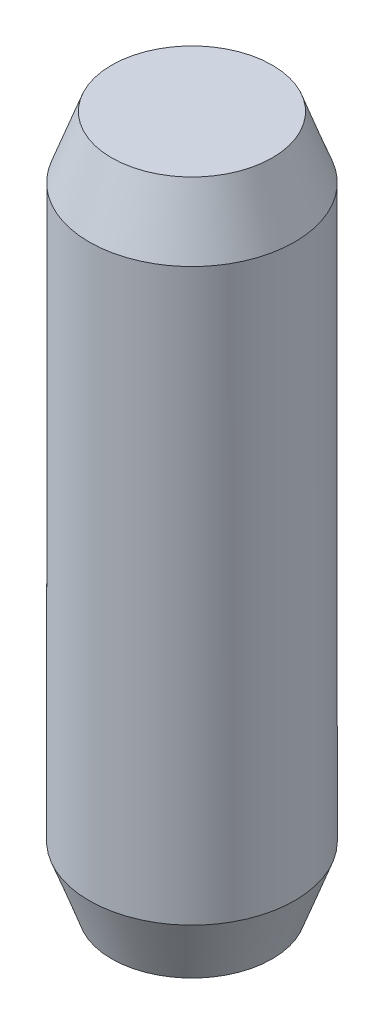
ISO-10303-21;
HEADER;
FILE_DESCRIPTION(('STEP AP214'),'2;1');
FILE_NAME('part.step','',(''),(''),'','','');
FILE_SCHEMA(('AUTOMOTIVE_DESIGN { 1 0 10303 214 1 1 1 1 }'));
ENDSEC;
DATA;
#1=APPLICATION_CONTEXT('core data for automotive mechanical design processes');
#2=APPLICATION_PROTOCOL_DEFINITION('international standard','automotive_design',2000,#1);
#3=PRODUCT_CONTEXT('',#1,'mechanical');
#4=PRODUCT('Part','Part','',(#3));
#5=PRODUCT_RELATED_PRODUCT_CATEGORY('part','',(#4));
#6=PRODUCT_DEFINITION_FORMATION('','',#4);
#7=PRODUCT_DEFINITION_CONTEXT('part definition',#1,'design');
#8=PRODUCT_DEFINITION('design','',#6,#7);
#9=PRODUCT_DEFINITION_SHAPE('','',#8);
#10=(LENGTH_UNIT() NAMED_UNIT(*) SI_UNIT(.MILLI.,.METRE.));
#11=(NAMED_UNIT(*) PLANE_ANGLE_UNIT() SI_UNIT($,.RADIAN.));
#12=(NAMED_UNIT(*) SI_UNIT($,.STERADIAN.) SOLID_ANGLE_UNIT());
#13=UNCERTAINTY_MEASURE_WITH_UNIT(LENGTH_MEASURE(1.E-05),#10,'distance_accuracy_value','');
#14=(GEOMETRIC_REPRESENTATION_CONTEXT(3) GLOBAL_UNCERTAINTY_ASSIGNED_CONTEXT((#13)) GLOBAL_UNIT_ASSIGNED_CONTEXT((#10,
#11,#12)) REPRESENTATION_CONTEXT('',''));
#15=CARTESIAN_POINT('',(0.,0.,0.));
#16=DIRECTION('',(0.,0.,1.));
#17=DIRECTION('',(1.,0.,0.));
#18=AXIS2_PLACEMENT_3D('',#15,#16,#17);
#19=CARTESIAN_POINT('',(0.,13.5,0.));
#20=DIRECTION('',(0.,1.,0.));
#21=DIRECTION('',(0.,0.,1.));
#22=AXIS2_PLACEMENT_3D('',#19,#20,#21);
#23=PLANE('',#22);
#24=CARTESIAN_POINT('',(0.,13.499999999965,0.));
#25=DIRECTION('',(0.,-1.,0.));
#26=DIRECTION('',(0.,0.,-1.));
#27=AXIS2_PLACEMENT_3D('',#24,#25,#26);
#28=CIRCLE('',#27,1.56323571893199);
#29=CARTESIAN_POINT('',(0.,13.499999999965,-1.56323571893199));
#30=VERTEX_POINT('',#29);
#31=EDGE_CURVE('E17',#30,#30,#28,.T.);
#32=ORIENTED_EDGE('',*,*,#31,.F.);
#33=EDGE_LOOP('',(#32));
#34=FACE_BOUND('',#33,.T.);
#35=ADVANCED_FACE('F14',(#34),#23,.T.);
#36=CARTESIAN_POINT('',(0.,0.,0.));
#37=DIRECTION('',(0.,1.,0.));
#38=DIRECTION('',(0.,0.,1.));
#39=AXIS2_PLACEMENT_3D('',#36,#37,#38);
#40=PLANE('',#39);
#41=CARTESIAN_POINT('',(0.,-5.6843418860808E-11,0.));
#42=DIRECTION('',(0.,1.,0.));
#43=DIRECTION('',(0.,0.,1.));
#44=AXIS2_PLACEMENT_3D('',#41,#42,#43);
#45=CIRCLE('',#44,1.56323571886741);
#46=CARTESIAN_POINT('',(0.,-5.6843418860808E-11,1.56323571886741));
#47=VERTEX_POINT('',#46);
#48=EDGE_CURVE('E26',#47,#47,#45,.T.);
#49=ORIENTED_EDGE('',*,*,#48,.F.);
#50=EDGE_LOOP('',(#49));
#51=FACE_BOUND('',#50,.T.);
#52=ADVANCED_FACE('F37',(#51),#40,.F.);
#53=CARTESIAN_POINT('',(0.,12.3000000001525,0.));
#54=DIRECTION('',(0.,-1.,0.));
#55=DIRECTION('',(0.,0.,-1.));
#56=AXIS2_PLACEMENT_3D('',#53,#54,#55);
#57=CONICAL_SURFACE('',#56,1.99999999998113,0.349065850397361);
#58=CARTESIAN_POINT('',(0.,12.3,0.));
#59=DIRECTION('',(0.,1.,0.));
#60=DIRECTION('',(0.,0.,1.));
#61=AXIS2_PLACEMENT_3D('',#58,#59,#60);
#62=CIRCLE('',#61,2.);
#63=CARTESIAN_POINT('',(0.,12.3,2.));
#64=VERTEX_POINT('',#63);
#65=EDGE_CURVE('E21',#64,#64,#62,.F.);
#66=ORIENTED_EDGE('',*,*,#65,.F.);
#67=EDGE_LOOP('',(#66));
#68=FACE_BOUND('',#67,.T.);
#69=ORIENTED_EDGE('',*,*,#31,.T.);
#70=EDGE_LOOP('',(#69));
#71=FACE_BOUND('',#70,.T.);
#72=ADVANCED_FACE('F34',(#68,#71),#57,.T.);
#73=CARTESIAN_POINT('',(0.,1.19999999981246,0.));
#74=DIRECTION('',(0.,1.,0.));
#75=DIRECTION('',(0.,0.,1.));
#76=AXIS2_PLACEMENT_3D('',#73,#74,#75);
#77=CONICAL_SURFACE('',#76,1.99999999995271,0.349065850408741);
#78=ORIENTED_EDGE('',*,*,#48,.T.);
#79=EDGE_LOOP('',(#78));
#80=FACE_BOUND('',#79,.T.);
#81=CARTESIAN_POINT('',(0.,1.2,0.));
#82=DIRECTION('',(0.,1.,0.));
#83=DIRECTION('',(0.,0.,1.));
#84=AXIS2_PLACEMENT_3D('',#81,#82,#83);
#85=CIRCLE('',#84,2.);
#86=CARTESIAN_POINT('',(0.,1.2,2.));
#87=VERTEX_POINT('',#86);
#88=EDGE_CURVE('E10',#87,#87,#85,.T.);
#89=ORIENTED_EDGE('',*,*,#88,.F.);
#90=EDGE_LOOP('',(#89));
#91=FACE_BOUND('',#90,.T.);
#92=ADVANCED_FACE('F45',(#80,#91),#77,.T.);
#93=CARTESIAN_POINT('',(0.,-0.675,0.));
#94=DIRECTION('',(0.,1.,0.));
#95=DIRECTION('',(0.,0.,1.));
#96=AXIS2_PLACEMENT_3D('',#93,#94,#95);
#97=CYLINDRICAL_SURFACE('',#96,2.);
#98=ORIENTED_EDGE('',*,*,#88,.T.);
#99=EDGE_LOOP('',(#98));
#100=FACE_BOUND('',#99,.T.);
#101=ORIENTED_EDGE('',*,*,#65,.T.);
#102=EDGE_LOOP('',(#101));
#103=FACE_BOUND('',#102,.T.);
#104=ADVANCED_FACE('F43',(#100,#103),#97,.T.);
#105=CLOSED_SHELL('',(#35,#52,#72,#92,#104));
#106=MANIFOLD_SOLID_BREP('B1',#105);
#107=ADVANCED_BREP_SHAPE_REPRESENTATION('',(#18,#106),#14);
#108=SHAPE_DEFINITION_REPRESENTATION(#9,#107);
ENDSEC;
END-ISO-10303-21;
